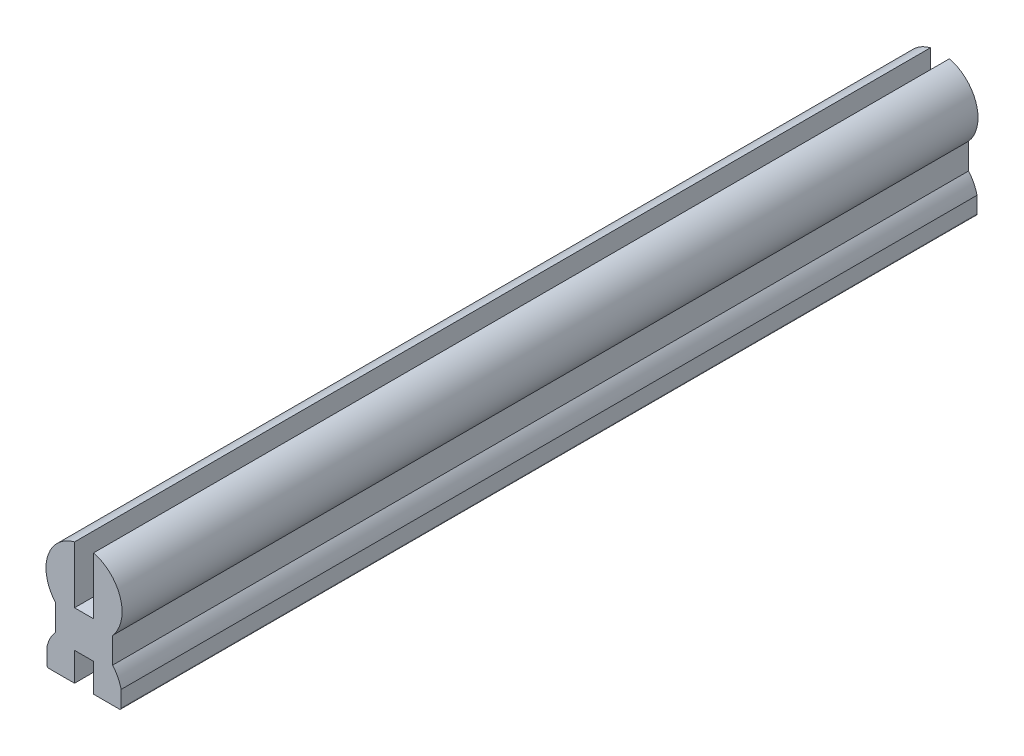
ISO-10303-21;
HEADER;
FILE_DESCRIPTION(('STEP AP214'),'2;1');
FILE_NAME('part.step','',(''),(''),'','','');
FILE_SCHEMA(('AUTOMOTIVE_DESIGN { 1 0 10303 214 1 1 1 1 }'));
ENDSEC;
DATA;
#1=APPLICATION_CONTEXT('core data for automotive mechanical design processes');
#2=APPLICATION_PROTOCOL_DEFINITION('international standard','automotive_design',2000,#1);
#3=PRODUCT_CONTEXT('',#1,'mechanical');
#4=PRODUCT('Part','Part','',(#3));
#5=PRODUCT_RELATED_PRODUCT_CATEGORY('part','',(#4));
#6=PRODUCT_DEFINITION_FORMATION('','',#4);
#7=PRODUCT_DEFINITION_CONTEXT('part definition',#1,'design');
#8=PRODUCT_DEFINITION('design','',#6,#7);
#9=PRODUCT_DEFINITION_SHAPE('','',#8);
#10=(LENGTH_UNIT() NAMED_UNIT(*) SI_UNIT(.MILLI.,.METRE.));
#11=(NAMED_UNIT(*) PLANE_ANGLE_UNIT() SI_UNIT($,.RADIAN.));
#12=(NAMED_UNIT(*) SI_UNIT($,.STERADIAN.) SOLID_ANGLE_UNIT());
#13=UNCERTAINTY_MEASURE_WITH_UNIT(LENGTH_MEASURE(1.E-05),#10,'distance_accuracy_value','');
#14=(GEOMETRIC_REPRESENTATION_CONTEXT(3) GLOBAL_UNCERTAINTY_ASSIGNED_CONTEXT((#13)) GLOBAL_UNIT_ASSIGNED_CONTEXT((#10,
#11,#12)) REPRESENTATION_CONTEXT('',''));
#15=CARTESIAN_POINT('',(0.,0.,0.));
#16=DIRECTION('',(0.,0.,1.));
#17=DIRECTION('',(1.,0.,0.));
#18=AXIS2_PLACEMENT_3D('',#15,#16,#17);
#19=CARTESIAN_POINT('',(0.,2.,-45.));
#20=DIRECTION('',(0.,0.,1.));
#21=DIRECTION('',(1.,0.,0.));
#22=AXIS2_PLACEMENT_3D('',#19,#20,#21);
#23=CYLINDRICAL_SURFACE('',#22,2.);
#24=CARTESIAN_POINT('',(0.,2.,0.));
#25=DIRECTION('',(0.,0.,1.));
#26=DIRECTION('',(1.,0.,0.));
#27=AXIS2_PLACEMENT_3D('',#24,#25,#26);
#28=CIRCLE('',#27,2.);
#29=CARTESIAN_POINT('',(1.5,0.677124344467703,0.));
#30=VERTEX_POINT('',#29);
#31=CARTESIAN_POINT('',(0.5,3.93649167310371,0.));
#32=VERTEX_POINT('',#31);
#33=EDGE_CURVE('E225',#30,#32,#28,.T.);
#34=ORIENTED_EDGE('',*,*,#33,.F.);
#35=DIRECTION('',(0.,0.,1.));
#36=VECTOR('',#35,1.);
#37=CARTESIAN_POINT('',(1.5,0.677124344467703,-45.));
#38=LINE('',#37,#36);
#39=CARTESIAN_POINT('',(1.5,0.677124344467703,-45.));
#40=VERTEX_POINT('',#39);
#41=EDGE_CURVE('E183',#40,#30,#38,.T.);
#42=ORIENTED_EDGE('',*,*,#41,.F.);
#43=CARTESIAN_POINT('',(0.,2.,-45.));
#44=DIRECTION('',(0.,0.,1.));
#45=DIRECTION('',(1.,0.,0.));
#46=AXIS2_PLACEMENT_3D('',#43,#44,#45);
#47=CIRCLE('',#46,2.);
#48=CARTESIAN_POINT('',(0.5,3.93649167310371,-45.));
#49=VERTEX_POINT('',#48);
#50=EDGE_CURVE('E177',#40,#49,#47,.T.);
#51=ORIENTED_EDGE('',*,*,#50,.T.);
#52=DIRECTION('',(0.,0.,1.));
#53=VECTOR('',#52,1.);
#54=CARTESIAN_POINT('',(0.5,3.93649167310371,-45.));
#55=LINE('',#54,#53);
#56=EDGE_CURVE('E159',#49,#32,#55,.T.);
#57=ORIENTED_EDGE('',*,*,#56,.T.);
#58=EDGE_LOOP('',(#34,#42,#51,#57));
#59=FACE_BOUND('',#58,.T.);
#60=ADVANCED_FACE('F34',(#59),#23,.T.);
#61=CARTESIAN_POINT('',(1.5,0.677124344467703,-45.));
#62=DIRECTION('',(1.,0.,0.));
#63=DIRECTION('',(0.,1.,0.));
#64=AXIS2_PLACEMENT_3D('',#61,#62,#63);
#65=PLANE('',#64);
#66=DIRECTION('',(0.,1.,0.));
#67=VECTOR('',#66,1.);
#68=CARTESIAN_POINT('',(1.5,0.677124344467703,0.));
#69=LINE('',#68,#67);
#70=CARTESIAN_POINT('',(1.5,-0.677124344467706,0.));
#71=VERTEX_POINT('',#70);
#72=EDGE_CURVE('E184',#71,#30,#69,.T.);
#73=ORIENTED_EDGE('',*,*,#72,.F.);
#74=DIRECTION('',(0.,0.,1.));
#75=VECTOR('',#74,1.);
#76=CARTESIAN_POINT('',(1.5,-0.677124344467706,-45.));
#77=LINE('',#76,#75);
#78=CARTESIAN_POINT('',(1.5,-0.677124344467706,-45.));
#79=VERTEX_POINT('',#78);
#80=EDGE_CURVE('E266',#79,#71,#77,.T.);
#81=ORIENTED_EDGE('',*,*,#80,.F.);
#82=DIRECTION('',(0.,1.,0.));
#83=VECTOR('',#82,1.);
#84=CARTESIAN_POINT('',(1.5,0.677124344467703,-45.));
#85=LINE('',#84,#83);
#86=EDGE_CURVE('E170',#79,#40,#85,.T.);
#87=ORIENTED_EDGE('',*,*,#86,.T.);
#88=ORIENTED_EDGE('',*,*,#41,.T.);
#89=EDGE_LOOP('',(#73,#81,#87,#88));
#90=FACE_BOUND('',#89,.T.);
#91=ADVANCED_FACE('F354',(#90),#65,.T.);
#92=CARTESIAN_POINT('',(0.,-2.,-45.));
#93=DIRECTION('',(0.,0.,1.));
#94=DIRECTION('',(1.,0.,0.));
#95=AXIS2_PLACEMENT_3D('',#92,#93,#94);
#96=CYLINDRICAL_SURFACE('',#95,2.);
#97=CARTESIAN_POINT('',(0.,-2.,0.));
#98=DIRECTION('',(0.,0.,1.));
#99=DIRECTION('',(1.,0.,0.));
#100=AXIS2_PLACEMENT_3D('',#97,#98,#99);
#101=CIRCLE('',#100,2.);
#102=CARTESIAN_POINT('',(1.95,-1.55559027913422,0.));
#103=VERTEX_POINT('',#102);
#104=EDGE_CURVE('E187',#103,#71,#101,.T.);
#105=ORIENTED_EDGE('',*,*,#104,.F.);
#106=DIRECTION('',(0.,0.,1.));
#107=VECTOR('',#106,1.);
#108=CARTESIAN_POINT('',(1.95,-1.55559027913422,-45.));
#109=LINE('',#108,#107);
#110=CARTESIAN_POINT('',(1.95,-1.55559027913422,-45.));
#111=VERTEX_POINT('',#110);
#112=EDGE_CURVE('E268',#111,#103,#109,.T.);
#113=ORIENTED_EDGE('',*,*,#112,.F.);
#114=CARTESIAN_POINT('',(0.,-2.,-45.));
#115=DIRECTION('',(0.,0.,1.));
#116=DIRECTION('',(1.,0.,0.));
#117=AXIS2_PLACEMENT_3D('',#114,#115,#116);
#118=CIRCLE('',#117,2.);
#119=EDGE_CURVE('E221',#111,#79,#118,.T.);
#120=ORIENTED_EDGE('',*,*,#119,.T.);
#121=ORIENTED_EDGE('',*,*,#80,.T.);
#122=EDGE_LOOP('',(#105,#113,#120,#121));
#123=FACE_BOUND('',#122,.T.);
#124=ADVANCED_FACE('F358',(#123),#96,.T.);
#125=CARTESIAN_POINT('',(1.95,-2.5,-45.));
#126=DIRECTION('',(1.,0.,0.));
#127=DIRECTION('',(0.,0.,-1.));
#128=AXIS2_PLACEMENT_3D('',#125,#126,#127);
#129=PLANE('',#128);
#130=DIRECTION('',(0.,1.,0.));
#131=VECTOR('',#130,1.);
#132=CARTESIAN_POINT('',(1.95,-2.5,0.));
#133=LINE('',#132,#131);
#134=CARTESIAN_POINT('',(1.95,-2.4,0.));
#135=VERTEX_POINT('',#134);
#136=EDGE_CURVE('E260',#135,#103,#133,.T.);
#137=ORIENTED_EDGE('',*,*,#136,.F.);
#138=DIRECTION('',(0.,0.,1.));
#139=VECTOR('',#138,1.);
#140=CARTESIAN_POINT('',(1.95,-2.4,-45.));
#141=LINE('',#140,#139);
#142=CARTESIAN_POINT('',(1.95,-2.4,-45.));
#143=VERTEX_POINT('',#142);
#144=EDGE_CURVE('E11',#135,#143,#141,.F.);
#145=ORIENTED_EDGE('',*,*,#144,.T.);
#146=DIRECTION('',(0.,1.,0.));
#147=VECTOR('',#146,1.);
#148=CARTESIAN_POINT('',(1.95,-2.5,-45.));
#149=LINE('',#148,#147);
#150=EDGE_CURVE('E219',#143,#111,#149,.T.);
#151=ORIENTED_EDGE('',*,*,#150,.T.);
#152=ORIENTED_EDGE('',*,*,#112,.T.);
#153=EDGE_LOOP('',(#137,#145,#151,#152));
#154=FACE_BOUND('',#153,.T.);
#155=ADVANCED_FACE('F359',(#154),#129,.T.);
#156=CARTESIAN_POINT('',(0.500000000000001,-2.5,-45.));
#157=DIRECTION('',(0.,-1.,0.));
#158=DIRECTION('',(1.,0.,0.));
#159=AXIS2_PLACEMENT_3D('',#156,#157,#158);
#160=PLANE('',#159);
#161=DIRECTION('',(1.,0.,0.));
#162=VECTOR('',#161,1.);
#163=CARTESIAN_POINT('',(0.500000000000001,-2.5,-45.));
#164=LINE('',#163,#162);
#165=CARTESIAN_POINT('',(0.500000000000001,-2.5,-45.));
#166=VERTEX_POINT('',#165);
#167=CARTESIAN_POINT('',(1.85,-2.5,-45.));
#168=VERTEX_POINT('',#167);
#169=EDGE_CURVE('E217',#166,#168,#164,.T.);
#170=ORIENTED_EDGE('',*,*,#169,.T.);
#171=DIRECTION('',(0.,0.,1.));
#172=VECTOR('',#171,1.);
#173=CARTESIAN_POINT('',(1.85,-2.5,-45.));
#174=LINE('',#173,#172);
#175=CARTESIAN_POINT('',(1.85,-2.5,0.));
#176=VERTEX_POINT('',#175);
#177=EDGE_CURVE('E42',#168,#176,#174,.T.);
#178=ORIENTED_EDGE('',*,*,#177,.T.);
#179=DIRECTION('',(1.,0.,0.));
#180=VECTOR('',#179,1.);
#181=CARTESIAN_POINT('',(0.500000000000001,-2.5,0.));
#182=LINE('',#181,#180);
#183=CARTESIAN_POINT('',(0.500000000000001,-2.5,0.));
#184=VERTEX_POINT('',#183);
#185=EDGE_CURVE('E257',#184,#176,#182,.T.);
#186=ORIENTED_EDGE('',*,*,#185,.F.);
#187=DIRECTION('',(0.,0.,1.));
#188=VECTOR('',#187,1.);
#189=CARTESIAN_POINT('',(0.500000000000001,-2.5,-45.));
#190=LINE('',#189,#188);
#191=EDGE_CURVE('E271',#166,#184,#190,.T.);
#192=ORIENTED_EDGE('',*,*,#191,.F.);
#193=EDGE_LOOP('',(#170,#178,#186,#192));
#194=FACE_BOUND('',#193,.T.);
#195=ADVANCED_FACE('F305',(#194),#160,.T.);
#196=CARTESIAN_POINT('',(0.5,-1.,-45.));
#197=DIRECTION('',(-1.,0.,0.));
#198=DIRECTION('',(0.,-1.,0.));
#199=AXIS2_PLACEMENT_3D('',#196,#197,#198);
#200=PLANE('',#199);
#201=DIRECTION('',(0.,-1.,0.));
#202=VECTOR('',#201,1.);
#203=CARTESIAN_POINT('',(0.5,-1.,0.));
#204=LINE('',#203,#202);
#205=CARTESIAN_POINT('',(0.5,-1.,0.));
#206=VERTEX_POINT('',#205);
#207=EDGE_CURVE('E254',#206,#184,#204,.T.);
#208=ORIENTED_EDGE('',*,*,#207,.F.);
#209=DIRECTION('',(0.,0.,1.));
#210=VECTOR('',#209,1.);
#211=CARTESIAN_POINT('',(0.5,-1.,-45.));
#212=LINE('',#211,#210);
#213=CARTESIAN_POINT('',(0.5,-1.,-45.));
#214=VERTEX_POINT('',#213);
#215=EDGE_CURVE('E273',#214,#206,#212,.T.);
#216=ORIENTED_EDGE('',*,*,#215,.F.);
#217=DIRECTION('',(0.,-1.,0.));
#218=VECTOR('',#217,1.);
#219=CARTESIAN_POINT('',(0.5,-1.,-45.));
#220=LINE('',#219,#218);
#221=EDGE_CURVE('E214',#214,#166,#220,.T.);
#222=ORIENTED_EDGE('',*,*,#221,.T.);
#223=ORIENTED_EDGE('',*,*,#191,.T.);
#224=EDGE_LOOP('',(#208,#216,#222,#223));
#225=FACE_BOUND('',#224,.T.);
#226=ADVANCED_FACE('F312',(#225),#200,.T.);
#227=CARTESIAN_POINT('',(-0.5,-1.,-45.));
#228=DIRECTION('',(0.,-1.,0.));
#229=DIRECTION('',(0.,0.,-1.));
#230=AXIS2_PLACEMENT_3D('',#227,#228,#229);
#231=PLANE('',#230);
#232=DIRECTION('',(1.,0.,0.));
#233=VECTOR('',#232,1.);
#234=CARTESIAN_POINT('',(-0.5,-1.,0.));
#235=LINE('',#234,#233);
#236=CARTESIAN_POINT('',(-0.5,-1.,0.));
#237=VERTEX_POINT('',#236);
#238=EDGE_CURVE('E251',#237,#206,#235,.T.);
#239=ORIENTED_EDGE('',*,*,#238,.F.);
#240=DIRECTION('',(0.,0.,1.));
#241=VECTOR('',#240,1.);
#242=CARTESIAN_POINT('',(-0.5,-1.,-45.));
#243=LINE('',#242,#241);
#244=CARTESIAN_POINT('',(-0.5,-1.,-45.));
#245=VERTEX_POINT('',#244);
#246=EDGE_CURVE('E275',#245,#237,#243,.T.);
#247=ORIENTED_EDGE('',*,*,#246,.F.);
#248=DIRECTION('',(1.,0.,0.));
#249=VECTOR('',#248,1.);
#250=CARTESIAN_POINT('',(-0.5,-1.,-45.));
#251=LINE('',#250,#249);
#252=EDGE_CURVE('E211',#245,#214,#251,.T.);
#253=ORIENTED_EDGE('',*,*,#252,.T.);
#254=ORIENTED_EDGE('',*,*,#215,.T.);
#255=EDGE_LOOP('',(#239,#247,#253,#254));
#256=FACE_BOUND('',#255,.T.);
#257=ADVANCED_FACE('F317',(#256),#231,.T.);
#258=CARTESIAN_POINT('',(-0.5,-1.,-45.));
#259=DIRECTION('',(1.,0.,0.));
#260=DIRECTION('',(0.,1.,0.));
#261=AXIS2_PLACEMENT_3D('',#258,#259,#260);
#262=PLANE('',#261);
#263=DIRECTION('',(0.,1.,0.));
#264=VECTOR('',#263,1.);
#265=CARTESIAN_POINT('',(-0.5,-1.,0.));
#266=LINE('',#265,#264);
#267=CARTESIAN_POINT('',(-0.5,-2.5,0.));
#268=VERTEX_POINT('',#267);
#269=EDGE_CURVE('E248',#268,#237,#266,.T.);
#270=ORIENTED_EDGE('',*,*,#269,.F.);
#271=DIRECTION('',(0.,0.,1.));
#272=VECTOR('',#271,1.);
#273=CARTESIAN_POINT('',(-0.5,-2.5,-45.));
#274=LINE('',#273,#272);
#275=CARTESIAN_POINT('',(-0.5,-2.5,-45.));
#276=VERTEX_POINT('',#275);
#277=EDGE_CURVE('E277',#276,#268,#274,.T.);
#278=ORIENTED_EDGE('',*,*,#277,.F.);
#279=DIRECTION('',(0.,1.,0.));
#280=VECTOR('',#279,1.);
#281=CARTESIAN_POINT('',(-0.5,-1.,-45.));
#282=LINE('',#281,#280);
#283=EDGE_CURVE('E208',#276,#245,#282,.T.);
#284=ORIENTED_EDGE('',*,*,#283,.T.);
#285=ORIENTED_EDGE('',*,*,#246,.T.);
#286=EDGE_LOOP('',(#270,#278,#284,#285));
#287=FACE_BOUND('',#286,.T.);
#288=ADVANCED_FACE('F320',(#287),#262,.T.);
#289=CARTESIAN_POINT('',(-1.95,-2.5,-45.));
#290=DIRECTION('',(0.,-1.,0.));
#291=DIRECTION('',(1.,0.,0.));
#292=AXIS2_PLACEMENT_3D('',#289,#290,#291);
#293=PLANE('',#292);
#294=DIRECTION('',(1.,0.,0.));
#295=VECTOR('',#294,1.);
#296=CARTESIAN_POINT('',(-1.95,-2.5,0.));
#297=LINE('',#296,#295);
#298=CARTESIAN_POINT('',(-1.85,-2.5,0.));
#299=VERTEX_POINT('',#298);
#300=EDGE_CURVE('E246',#299,#268,#297,.T.);
#301=ORIENTED_EDGE('',*,*,#300,.F.);
#302=DIRECTION('',(0.,0.,1.));
#303=VECTOR('',#302,1.);
#304=CARTESIAN_POINT('',(-1.85,-2.5,-45.));
#305=LINE('',#304,#303);
#306=CARTESIAN_POINT('',(-1.85,-2.5,-45.));
#307=VERTEX_POINT('',#306);
#308=EDGE_CURVE('E297',#299,#307,#305,.F.);
#309=ORIENTED_EDGE('',*,*,#308,.T.);
#310=DIRECTION('',(1.,0.,0.));
#311=VECTOR('',#310,1.);
#312=CARTESIAN_POINT('',(-1.95,-2.5,-45.));
#313=LINE('',#312,#311);
#314=EDGE_CURVE('E206',#307,#276,#313,.T.);
#315=ORIENTED_EDGE('',*,*,#314,.T.);
#316=ORIENTED_EDGE('',*,*,#277,.T.);
#317=EDGE_LOOP('',(#301,#309,#315,#316));
#318=FACE_BOUND('',#317,.T.);
#319=ADVANCED_FACE('F385',(#318),#293,.T.);
#320=CARTESIAN_POINT('',(-1.95,-2.5,-45.));
#321=DIRECTION('',(-1.,0.,0.));
#322=DIRECTION('',(0.,0.,1.));
#323=AXIS2_PLACEMENT_3D('',#320,#321,#322);
#324=PLANE('',#323);
#325=DIRECTION('',(0.,-1.,0.));
#326=VECTOR('',#325,1.);
#327=CARTESIAN_POINT('',(-1.95,-2.5,-45.));
#328=LINE('',#327,#326);
#329=CARTESIAN_POINT('',(-1.95,-1.55559027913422,-45.));
#330=VERTEX_POINT('',#329);
#331=CARTESIAN_POINT('',(-1.95,-2.4,-45.));
#332=VERTEX_POINT('',#331);
#333=EDGE_CURVE('E203',#330,#332,#328,.T.);
#334=ORIENTED_EDGE('',*,*,#333,.T.);
#335=DIRECTION('',(0.,0.,1.));
#336=VECTOR('',#335,1.);
#337=CARTESIAN_POINT('',(-1.95,-2.4,-45.));
#338=LINE('',#337,#336);
#339=CARTESIAN_POINT('',(-1.95,-2.4,0.));
#340=VERTEX_POINT('',#339);
#341=EDGE_CURVE('E265',#332,#340,#338,.T.);
#342=ORIENTED_EDGE('',*,*,#341,.T.);
#343=DIRECTION('',(0.,-1.,0.));
#344=VECTOR('',#343,1.);
#345=CARTESIAN_POINT('',(-1.95,-2.5,0.));
#346=LINE('',#345,#344);
#347=CARTESIAN_POINT('',(-1.95,-1.55559027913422,0.));
#348=VERTEX_POINT('',#347);
#349=EDGE_CURVE('E243',#348,#340,#346,.T.);
#350=ORIENTED_EDGE('',*,*,#349,.F.);
#351=DIRECTION('',(0.,0.,1.));
#352=VECTOR('',#351,1.);
#353=CARTESIAN_POINT('',(-1.95,-1.55559027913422,-45.));
#354=LINE('',#353,#352);
#355=EDGE_CURVE('E280',#330,#348,#354,.T.);
#356=ORIENTED_EDGE('',*,*,#355,.F.);
#357=EDGE_LOOP('',(#334,#342,#350,#356));
#358=FACE_BOUND('',#357,.T.);
#359=ADVANCED_FACE('F331',(#358),#324,.T.);
#360=CARTESIAN_POINT('',(0.,-2.,-45.));
#361=DIRECTION('',(0.,0.,1.));
#362=DIRECTION('',(1.,0.,0.));
#363=AXIS2_PLACEMENT_3D('',#360,#361,#362);
#364=CYLINDRICAL_SURFACE('',#363,2.);
#365=CARTESIAN_POINT('',(0.,-2.,0.));
#366=DIRECTION('',(0.,0.,1.));
#367=DIRECTION('',(1.,0.,0.));
#368=AXIS2_PLACEMENT_3D('',#365,#366,#367);
#369=CIRCLE('',#368,2.);
#370=CARTESIAN_POINT('',(-1.5,-0.677124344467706,0.));
#371=VERTEX_POINT('',#370);
#372=EDGE_CURVE('E240',#371,#348,#369,.T.);
#373=ORIENTED_EDGE('',*,*,#372,.F.);
#374=DIRECTION('',(0.,0.,1.));
#375=VECTOR('',#374,1.);
#376=CARTESIAN_POINT('',(-1.5,-0.677124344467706,-45.));
#377=LINE('',#376,#375);
#378=CARTESIAN_POINT('',(-1.5,-0.677124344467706,-45.));
#379=VERTEX_POINT('',#378);
#380=EDGE_CURVE('E282',#379,#371,#377,.T.);
#381=ORIENTED_EDGE('',*,*,#380,.F.);
#382=CARTESIAN_POINT('',(0.,-2.,-45.));
#383=DIRECTION('',(0.,0.,1.));
#384=DIRECTION('',(1.,0.,0.));
#385=AXIS2_PLACEMENT_3D('',#382,#383,#384);
#386=CIRCLE('',#385,2.);
#387=EDGE_CURVE('E200',#379,#330,#386,.T.);
#388=ORIENTED_EDGE('',*,*,#387,.T.);
#389=ORIENTED_EDGE('',*,*,#355,.T.);
#390=EDGE_LOOP('',(#373,#381,#388,#389));
#391=FACE_BOUND('',#390,.T.);
#392=ADVANCED_FACE('F336',(#391),#364,.T.);
#393=CARTESIAN_POINT('',(-1.5,0.677124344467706,-45.));
#394=DIRECTION('',(-1.,0.,0.));
#395=DIRECTION('',(0.,0.,1.));
#396=AXIS2_PLACEMENT_3D('',#393,#394,#395);
#397=PLANE('',#396);
#398=DIRECTION('',(0.,-1.,0.));
#399=VECTOR('',#398,1.);
#400=CARTESIAN_POINT('',(-1.5,0.677124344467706,0.));
#401=LINE('',#400,#399);
#402=CARTESIAN_POINT('',(-1.5,0.677124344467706,0.));
#403=VERTEX_POINT('',#402);
#404=EDGE_CURVE('E237',#403,#371,#401,.T.);
#405=ORIENTED_EDGE('',*,*,#404,.F.);
#406=DIRECTION('',(0.,0.,1.));
#407=VECTOR('',#406,1.);
#408=CARTESIAN_POINT('',(-1.5,0.677124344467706,-45.));
#409=LINE('',#408,#407);
#410=CARTESIAN_POINT('',(-1.5,0.677124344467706,-45.));
#411=VERTEX_POINT('',#410);
#412=EDGE_CURVE('E284',#411,#403,#409,.T.);
#413=ORIENTED_EDGE('',*,*,#412,.F.);
#414=DIRECTION('',(0.,-1.,0.));
#415=VECTOR('',#414,1.);
#416=CARTESIAN_POINT('',(-1.5,0.677124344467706,-45.));
#417=LINE('',#416,#415);
#418=EDGE_CURVE('E197',#411,#379,#417,.T.);
#419=ORIENTED_EDGE('',*,*,#418,.T.);
#420=ORIENTED_EDGE('',*,*,#380,.T.);
#421=EDGE_LOOP('',(#405,#413,#419,#420));
#422=FACE_BOUND('',#421,.T.);
#423=ADVANCED_FACE('F341',(#422),#397,.T.);
#424=CARTESIAN_POINT('',(0.,2.,-45.));
#425=DIRECTION('',(0.,0.,1.));
#426=DIRECTION('',(1.,0.,0.));
#427=AXIS2_PLACEMENT_3D('',#424,#425,#426);
#428=CYLINDRICAL_SURFACE('',#427,2.);
#429=CARTESIAN_POINT('',(0.,2.,0.));
#430=DIRECTION('',(0.,0.,1.));
#431=DIRECTION('',(1.,0.,0.));
#432=AXIS2_PLACEMENT_3D('',#429,#430,#431);
#433=CIRCLE('',#432,2.);
#434=CARTESIAN_POINT('',(-0.500000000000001,3.93649167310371,0.));
#435=VERTEX_POINT('',#434);
#436=EDGE_CURVE('E234',#435,#403,#433,.T.);
#437=ORIENTED_EDGE('',*,*,#436,.F.);
#438=DIRECTION('',(0.,0.,1.));
#439=VECTOR('',#438,1.);
#440=CARTESIAN_POINT('',(-0.500000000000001,3.93649167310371,-45.));
#441=LINE('',#440,#439);
#442=CARTESIAN_POINT('',(-0.500000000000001,3.93649167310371,-45.));
#443=VERTEX_POINT('',#442);
#444=EDGE_CURVE('E286',#443,#435,#441,.T.);
#445=ORIENTED_EDGE('',*,*,#444,.F.);
#446=CARTESIAN_POINT('',(0.,2.,-45.));
#447=DIRECTION('',(0.,0.,1.));
#448=DIRECTION('',(1.,0.,0.));
#449=AXIS2_PLACEMENT_3D('',#446,#447,#448);
#450=CIRCLE('',#449,2.);
#451=EDGE_CURVE('E194',#443,#411,#450,.T.);
#452=ORIENTED_EDGE('',*,*,#451,.T.);
#453=ORIENTED_EDGE('',*,*,#412,.T.);
#454=EDGE_LOOP('',(#437,#445,#452,#453));
#455=FACE_BOUND('',#454,.T.);
#456=ADVANCED_FACE('F344',(#455),#428,.T.);
#457=CARTESIAN_POINT('',(-0.500000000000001,3.93649167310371,-45.));
#458=DIRECTION('',(1.,0.,0.));
#459=DIRECTION('',(0.,1.,0.));
#460=AXIS2_PLACEMENT_3D('',#457,#458,#459);
#461=PLANE('',#460);
#462=DIRECTION('',(0.,1.,0.));
#463=VECTOR('',#462,1.);
#464=CARTESIAN_POINT('',(-0.500000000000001,3.93649167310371,0.));
#465=LINE('',#464,#463);
#466=CARTESIAN_POINT('',(-0.5,0.936491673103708,0.));
#467=VERTEX_POINT('',#466);
#468=EDGE_CURVE('E231',#467,#435,#465,.T.);
#469=ORIENTED_EDGE('',*,*,#468,.F.);
#470=DIRECTION('',(0.,0.,1.));
#471=VECTOR('',#470,1.);
#472=CARTESIAN_POINT('',(-0.5,0.936491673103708,-45.));
#473=LINE('',#472,#471);
#474=CARTESIAN_POINT('',(-0.5,0.936491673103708,-45.));
#475=VERTEX_POINT('',#474);
#476=EDGE_CURVE('E288',#475,#467,#473,.T.);
#477=ORIENTED_EDGE('',*,*,#476,.F.);
#478=DIRECTION('',(0.,1.,0.));
#479=VECTOR('',#478,1.);
#480=CARTESIAN_POINT('',(-0.500000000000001,3.93649167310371,-45.));
#481=LINE('',#480,#479);
#482=EDGE_CURVE('E191',#475,#443,#481,.T.);
#483=ORIENTED_EDGE('',*,*,#482,.T.);
#484=ORIENTED_EDGE('',*,*,#444,.T.);
#485=EDGE_LOOP('',(#469,#477,#483,#484));
#486=FACE_BOUND('',#485,.T.);
#487=ADVANCED_FACE('F347',(#486),#461,.T.);
#488=CARTESIAN_POINT('',(-0.5,0.936491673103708,-45.));
#489=DIRECTION('',(0.,1.,0.));
#490=DIRECTION('',(0.,0.,1.));
#491=AXIS2_PLACEMENT_3D('',#488,#489,#490);
#492=PLANE('',#491);
#493=DIRECTION('',(-1.,0.,0.));
#494=VECTOR('',#493,1.);
#495=CARTESIAN_POINT('',(-0.5,0.936491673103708,0.));
#496=LINE('',#495,#494);
#497=CARTESIAN_POINT('',(0.5,0.936491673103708,0.));
#498=VERTEX_POINT('',#497);
#499=EDGE_CURVE('E228',#498,#467,#496,.T.);
#500=ORIENTED_EDGE('',*,*,#499,.F.);
#501=DIRECTION('',(0.,0.,1.));
#502=VECTOR('',#501,1.);
#503=CARTESIAN_POINT('',(0.5,0.936491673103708,-45.));
#504=LINE('',#503,#502);
#505=CARTESIAN_POINT('',(0.5,0.936491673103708,-45.));
#506=VERTEX_POINT('',#505);
#507=EDGE_CURVE('E169',#506,#498,#504,.T.);
#508=ORIENTED_EDGE('',*,*,#507,.F.);
#509=DIRECTION('',(-1.,0.,0.));
#510=VECTOR('',#509,1.);
#511=CARTESIAN_POINT('',(-0.5,0.936491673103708,-45.));
#512=LINE('',#511,#510);
#513=EDGE_CURVE('E181',#506,#475,#512,.T.);
#514=ORIENTED_EDGE('',*,*,#513,.T.);
#515=ORIENTED_EDGE('',*,*,#476,.T.);
#516=EDGE_LOOP('',(#500,#508,#514,#515));
#517=FACE_BOUND('',#516,.T.);
#518=ADVANCED_FACE('F350',(#517),#492,.T.);
#519=CARTESIAN_POINT('',(0.5,0.936491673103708,-45.));
#520=DIRECTION('',(-1.,0.,0.));
#521=DIRECTION('',(0.,0.,1.));
#522=AXIS2_PLACEMENT_3D('',#519,#520,#521);
#523=PLANE('',#522);
#524=DIRECTION('',(0.,-1.,0.));
#525=VECTOR('',#524,1.);
#526=CARTESIAN_POINT('',(0.5,0.936491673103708,0.));
#527=LINE('',#526,#525);
#528=EDGE_CURVE('E164',#32,#498,#527,.T.);
#529=ORIENTED_EDGE('',*,*,#528,.F.);
#530=ORIENTED_EDGE('',*,*,#56,.F.);
#531=DIRECTION('',(0.,-1.,0.));
#532=VECTOR('',#531,1.);
#533=CARTESIAN_POINT('',(0.5,0.936491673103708,-45.));
#534=LINE('',#533,#532);
#535=EDGE_CURVE('E162',#49,#506,#534,.T.);
#536=ORIENTED_EDGE('',*,*,#535,.T.);
#537=ORIENTED_EDGE('',*,*,#507,.T.);
#538=EDGE_LOOP('',(#529,#530,#536,#537));
#539=FACE_BOUND('',#538,.T.);
#540=ADVANCED_FACE('F161',(#539),#523,.T.);
#541=CARTESIAN_POINT('',(0.,2.,-45.));
#542=DIRECTION('',(0.,0.,1.));
#543=DIRECTION('',(1.,0.,0.));
#544=AXIS2_PLACEMENT_3D('',#541,#542,#543);
#545=PLANE('',#544);
#546=ORIENTED_EDGE('',*,*,#314,.F.);
#547=CARTESIAN_POINT('',(-1.85,-2.4,-45.));
#548=DIRECTION('',(0.,0.,1.));
#549=DIRECTION('',(1.,0.,0.));
#550=AXIS2_PLACEMENT_3D('',#547,#548,#549);
#551=CIRCLE('',#550,0.1);
#552=EDGE_CURVE('E300',#307,#332,#551,.F.);
#553=ORIENTED_EDGE('',*,*,#552,.T.);
#554=ORIENTED_EDGE('',*,*,#333,.F.);
#555=ORIENTED_EDGE('',*,*,#387,.F.);
#556=ORIENTED_EDGE('',*,*,#418,.F.);
#557=ORIENTED_EDGE('',*,*,#451,.F.);
#558=ORIENTED_EDGE('',*,*,#482,.F.);
#559=ORIENTED_EDGE('',*,*,#513,.F.);
#560=ORIENTED_EDGE('',*,*,#535,.F.);
#561=ORIENTED_EDGE('',*,*,#50,.F.);
#562=ORIENTED_EDGE('',*,*,#86,.F.);
#563=ORIENTED_EDGE('',*,*,#119,.F.);
#564=ORIENTED_EDGE('',*,*,#150,.F.);
#565=CARTESIAN_POINT('',(1.85,-2.4,-45.));
#566=DIRECTION('',(0.,0.,1.));
#567=DIRECTION('',(1.,0.,0.));
#568=AXIS2_PLACEMENT_3D('',#565,#566,#567);
#569=CIRCLE('',#568,0.1);
#570=EDGE_CURVE('E49',#143,#168,#569,.F.);
#571=ORIENTED_EDGE('',*,*,#570,.T.);
#572=ORIENTED_EDGE('',*,*,#169,.F.);
#573=ORIENTED_EDGE('',*,*,#221,.F.);
#574=ORIENTED_EDGE('',*,*,#252,.F.);
#575=ORIENTED_EDGE('',*,*,#283,.F.);
#576=EDGE_LOOP('',(#546,#553,#554,#555,#556,#557,#558,#559,#560,#561,#562,#563,#564,#571,#572,
#573,#574,#575));
#577=FACE_BOUND('',#576,.T.);
#578=ADVANCED_FACE('F175',(#577),#545,.F.);
#579=CARTESIAN_POINT('',(0.,2.,0.));
#580=DIRECTION('',(0.,0.,1.));
#581=DIRECTION('',(1.,0.,0.));
#582=AXIS2_PLACEMENT_3D('',#579,#580,#581);
#583=PLANE('',#582);
#584=ORIENTED_EDGE('',*,*,#349,.T.);
#585=CARTESIAN_POINT('',(-1.85,-2.4,0.));
#586=DIRECTION('',(0.,0.,1.));
#587=DIRECTION('',(1.,0.,0.));
#588=AXIS2_PLACEMENT_3D('',#585,#586,#587);
#589=CIRCLE('',#588,0.1);
#590=EDGE_CURVE('E295',#340,#299,#589,.T.);
#591=ORIENTED_EDGE('',*,*,#590,.T.);
#592=ORIENTED_EDGE('',*,*,#300,.T.);
#593=ORIENTED_EDGE('',*,*,#269,.T.);
#594=ORIENTED_EDGE('',*,*,#238,.T.);
#595=ORIENTED_EDGE('',*,*,#207,.T.);
#596=ORIENTED_EDGE('',*,*,#185,.T.);
#597=CARTESIAN_POINT('',(1.85,-2.4,0.));
#598=DIRECTION('',(0.,0.,1.));
#599=DIRECTION('',(1.,0.,0.));
#600=AXIS2_PLACEMENT_3D('',#597,#598,#599);
#601=CIRCLE('',#600,0.1);
#602=EDGE_CURVE('E293',#176,#135,#601,.T.);
#603=ORIENTED_EDGE('',*,*,#602,.T.);
#604=ORIENTED_EDGE('',*,*,#136,.T.);
#605=ORIENTED_EDGE('',*,*,#104,.T.);
#606=ORIENTED_EDGE('',*,*,#72,.T.);
#607=ORIENTED_EDGE('',*,*,#33,.T.);
#608=ORIENTED_EDGE('',*,*,#528,.T.);
#609=ORIENTED_EDGE('',*,*,#499,.T.);
#610=ORIENTED_EDGE('',*,*,#468,.T.);
#611=ORIENTED_EDGE('',*,*,#436,.T.);
#612=ORIENTED_EDGE('',*,*,#404,.T.);
#613=ORIENTED_EDGE('',*,*,#372,.T.);
#614=EDGE_LOOP('',(#584,#591,#592,#593,#594,#595,#596,#603,#604,#605,#606,#607,#608,#609,#610,
#611,#612,#613));
#615=FACE_BOUND('',#614,.T.);
#616=ADVANCED_FACE('F308',(#615),#583,.T.);
#617=CARTESIAN_POINT('',(-1.85,-2.4,-45.));
#618=DIRECTION('',(0.,0.,1.));
#619=DIRECTION('',(1.,0.,0.));
#620=AXIS2_PLACEMENT_3D('',#617,#618,#619);
#621=CYLINDRICAL_SURFACE('',#620,0.1);
#622=ORIENTED_EDGE('',*,*,#552,.F.);
#623=ORIENTED_EDGE('',*,*,#308,.F.);
#624=ORIENTED_EDGE('',*,*,#590,.F.);
#625=ORIENTED_EDGE('',*,*,#341,.F.);
#626=EDGE_LOOP('',(#622,#623,#624,#625));
#627=FACE_BOUND('',#626,.T.);
#628=ADVANCED_FACE('F328',(#627),#621,.T.);
#629=CARTESIAN_POINT('',(1.85,-2.4,-45.));
#630=DIRECTION('',(0.,0.,1.));
#631=DIRECTION('',(1.,0.,0.));
#632=AXIS2_PLACEMENT_3D('',#629,#630,#631);
#633=CYLINDRICAL_SURFACE('',#632,0.1);
#634=ORIENTED_EDGE('',*,*,#570,.F.);
#635=ORIENTED_EDGE('',*,*,#144,.F.);
#636=ORIENTED_EDGE('',*,*,#602,.F.);
#637=ORIENTED_EDGE('',*,*,#177,.F.);
#638=EDGE_LOOP('',(#634,#635,#636,#637));
#639=FACE_BOUND('',#638,.T.);
#640=ADVANCED_FACE('F36',(#639),#633,.T.);
#641=CLOSED_SHELL('',(#60,#91,#124,#155,#195,#226,#257,#288,#319,#359,#392,#423,#456,#487,#518,
#540,#578,#616,#628,#640));
#642=MANIFOLD_SOLID_BREP('B2',#641);
#643=ADVANCED_BREP_SHAPE_REPRESENTATION('',(#18,#642),#14);
#644=SHAPE_DEFINITION_REPRESENTATION(#9,#643);
ENDSEC;
END-ISO-10303-21;
